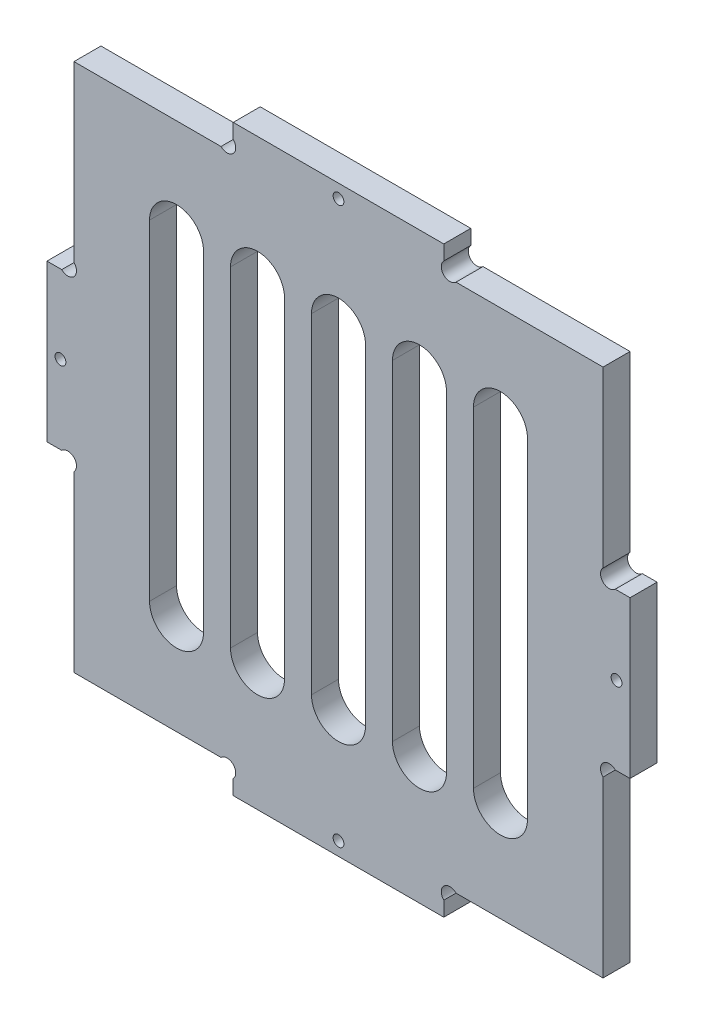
from build123d import *

# Parameters (mm, degrees)
ESQUISSE1_R        = 1
BOSS_EXTRU_1_DEPTH = 5


with BuildPart() as part:
    # Esquisse1 → Boss.-Extru.1 (new body)
    with BuildSketch(Plane.XY):
        with BuildLine():
            Line((73.509303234, -36.054777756), (76.246561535, -36.054777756))
            Line((76.246561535, -36.054777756), (76.246561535, -7.054777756))
            Line((76.246561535, -7.054777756), (73.509303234, -7.054777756))
            ThreePointArc((73.509303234, -7.054777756), (71.246561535, -7.054777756), (71.246561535, -4.792036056))
            Line((71.246561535, -4.792036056), (71.246561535, 27.445222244))
            Line((71.246561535, 27.445222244), (44.009303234, 27.445222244))
            ThreePointArc((44.009303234, 27.445222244), (41.746561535, 27.445222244), (41.746561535, 29.707963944))
            Line((41.746561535, 29.707963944), (41.746561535, 32.445222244))
            Line((41.746561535, 32.445222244), (2.746561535, 32.445222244))
            Line((2.746561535, 32.445222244), (2.746561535, 29.707963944))
            ThreePointArc((2.746561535, 29.707963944), (2.746561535, 27.445222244), (0.483819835, 27.445222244))
            Line((0.483819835, 27.445222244), (-26.753438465, 27.445222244))
            Line((-26.753438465, 27.445222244), (-26.753438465, -4.792036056))
            ThreePointArc((-26.753438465, -4.792036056), (-26.753438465, -7.054777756), (-29.016180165, -7.054777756))
            Line((-29.016180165, -7.054777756), (-31.753438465, -7.054777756))
            Line((-31.753438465, -7.054777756), (-31.753438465, -36.054777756))
            Line((-31.753438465, -36.054777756), (-29.016180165, -36.054777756))
            ThreePointArc((-29.016180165, -36.054777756), (-26.753438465, -36.054777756), (-26.753438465, -38.317519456))
            Line((-26.753438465, -38.317519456), (-26.753438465, -70.554777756))
            Line((-26.753438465, -70.554777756), (0.483819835, -70.554777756))
            ThreePointArc((0.483819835, -70.554777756), (2.746561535, -70.554777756), (2.746561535, -72.817519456))
            Line((2.746561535, -72.817519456), (2.746561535, -75.554777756))
            Line((2.746561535, -75.554777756), (41.746561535, -75.554777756))
            Line((41.746561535, -75.554777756), (41.746561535, -72.817519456))
            ThreePointArc((41.746561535, -72.817519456), (41.746561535, -70.554777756), (44.009303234, -70.554777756))
            Line((44.009303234, -70.554777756), (71.246561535, -70.554777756))
            Line((71.246561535, -70.554777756), (71.246561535, -38.317519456))
            ThreePointArc((71.246561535, -38.317519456), (71.246561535, -36.054777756), (73.509303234, -36.054777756))
        make_face()
        with Locations((73.746561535, -21.554777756)):
            Circle(ESQUISSE1_R, mode=Mode.SUBTRACT)
        with Locations((22.246561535, -73.054777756)):
            Circle(ESQUISSE1_R, mode=Mode.SUBTRACT)
        with Locations(Location((-29.253438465, -21.554777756, 0), (0, 0, 180))):
            Circle(ESQUISSE1_R, mode=Mode.SUBTRACT)
        with Locations(Location((22.246561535, 29.945222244, 0), (0, 0, 180))):
            Circle(ESQUISSE1_R, mode=Mode.SUBTRACT)
        with BuildLine():
            Line((17.246561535, 9.015222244), (17.246561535, -52.124777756))
            ThreePointArc((17.246561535, -52.124777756), (22.246561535, -57.124777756), (27.246561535, -52.124777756))
            Line((27.246561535, -52.124777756), (27.246561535, 9.015222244))
            ThreePointArc((27.246561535, 9.015222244), (22.246561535, 14.015222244), (17.246561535, 9.015222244))
        make_face(mode=Mode.SUBTRACT)
        with BuildLine():
            Line((32.246561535, 9.015222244), (32.246561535, -52.124777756))
            ThreePointArc((32.246561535, -52.124777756), (37.246561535, -57.124777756), (42.246561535, -52.124777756))
            Line((42.246561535, -52.124777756), (42.246561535, 9.015222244))
            ThreePointArc((42.246561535, 9.015222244), (37.246561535, 14.015222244), (32.246561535, 9.015222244))
        make_face(mode=Mode.SUBTRACT)
        with BuildLine():
            Line((47.246561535, 9.015222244), (47.246561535, -52.124777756))
            ThreePointArc((47.246561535, -52.124777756), (52.246561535, -57.124777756), (57.246561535, -52.124777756))
            Line((57.246561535, -52.124777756), (57.246561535, 9.015222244))
            ThreePointArc((57.246561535, 9.015222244), (52.246561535, 14.015222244), (47.246561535, 9.015222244))
        make_face(mode=Mode.SUBTRACT)
        with BuildLine():
            Line((12.246561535, 9.015222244), (12.246561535, -52.124777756))
            ThreePointArc((12.246561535, -52.124777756), (7.246561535, -57.124777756), (2.246561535, -52.124777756))
            Line((2.246561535, -52.124777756), (2.246561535, 9.015222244))
            ThreePointArc((2.246561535, 9.015222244), (7.246561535, 14.015222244), (12.246561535, 9.015222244))
        make_face(mode=Mode.SUBTRACT)
        with BuildLine():
            Line((-2.753438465, 9.015222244), (-2.753438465, -52.124777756))
            ThreePointArc((-2.753438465, -52.124777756), (-7.753438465, -57.124777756), (-12.753438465, -52.124777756))
            Line((-12.753438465, -52.124777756), (-12.753438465, 9.015222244))
            ThreePointArc((-12.753438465, 9.015222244), (-7.753438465, 14.015222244), (-2.753438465, 9.015222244))
        make_face(mode=Mode.SUBTRACT)
    extrude(amount=BOSS_EXTRU_1_DEPTH)


solid = part.part
